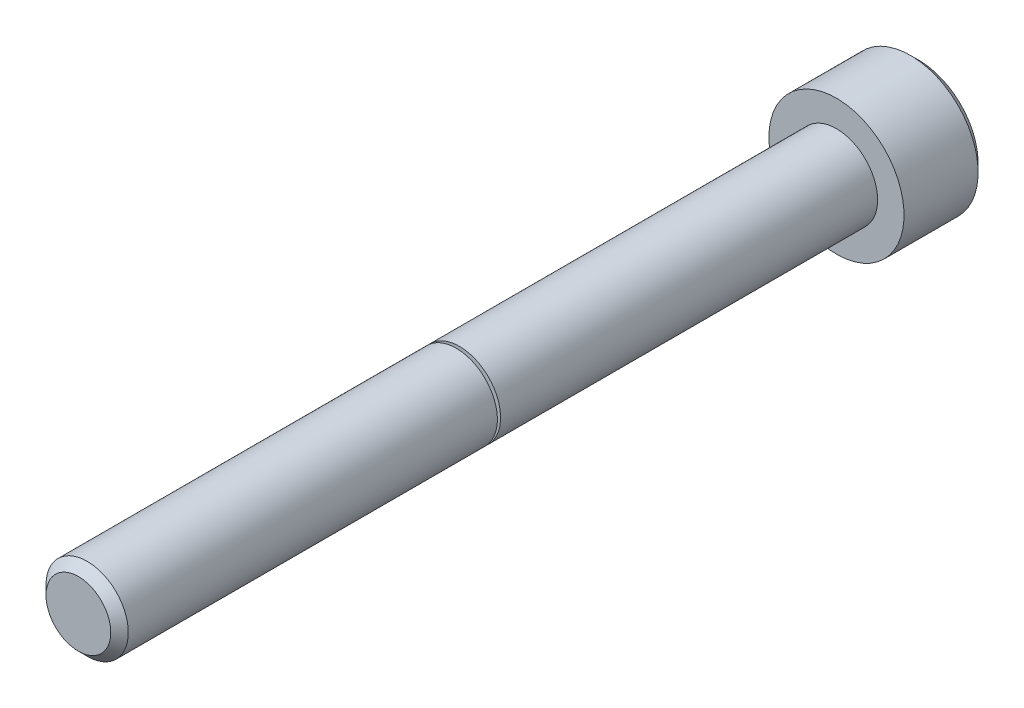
from build123d import *

# Parameters (mm, degrees)
CUT_EXTRUDE1_DEPTH = 2.413


with BuildPart() as part:
    # Logo3_bib1 → Revolve1 (revolve)
    with BuildSketch(Plane(origin=(0, 0, 0), x_dir=(-1, 0, 0), z_dir=(0, -1, 0))):
        with BuildLine():
            Line((0, -44.45), (0, 4.826))
            Line((0, 4.826), (3.4798, 4.826))
            Line((3.4798, 4.826), (3.9624, 4.3434))
            Line((3.9624, 4.3434), (3.9624, 0))
            Line((3.9624, 0), (2.413, 0))
            Line((2.413, 0), (2.413, -22.108))
            Line((2.413, -22.108), (2.012075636, -22.108))
            ThreePointArc((2.012075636, -22.108), (1.992379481, -22.124527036), (2.005235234, -22.146793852))
            Line((2.005235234, -22.146793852), (2.413, -22.29520809))
            Line((2.413, -22.29520809), (2.413, -43.93565))
            Line((2.413, -43.93565), (1.89865, -44.45))
            Line((1.89865, -44.45), (0, -44.45))
        make_face()
    revolve(axis=Axis((0, 0, -10.585154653), (0, 0, 1)))

    # Logo3_bib2 → Cut-Extrude1 (cut)
    with BuildSketch(Plane(origin=(0, 0, -4.826), x_dir=(1, 0, 0), z_dir=(0, 0, -1))):
        Polygon((2.291358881, 0), (1.14567944, 1.984375), (-1.14567944, 1.984375), (-2.291358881, 0), (-1.14567944, -1.984375), (1.14567944, -1.984375), align=None)
    extrude(amount=-CUT_EXTRUDE1_DEPTH, mode=Mode.SUBTRACT)


solid = part.part
